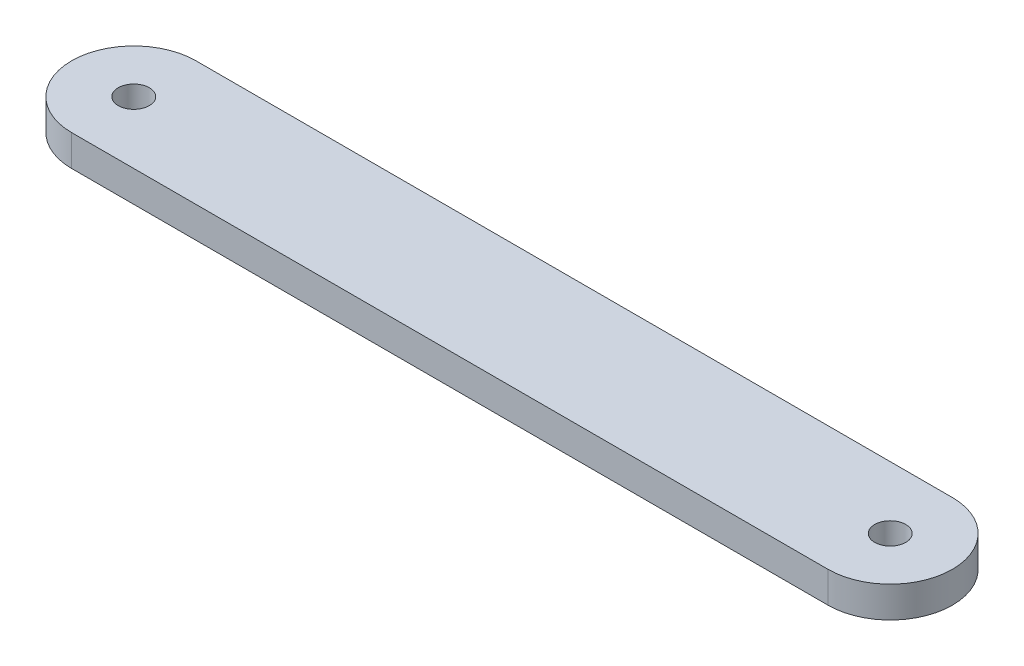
ISO-10303-21;
HEADER;
FILE_DESCRIPTION(('STEP AP214'),'2;1');
FILE_NAME('part.step','',(''),(''),'','','');
FILE_SCHEMA(('AUTOMOTIVE_DESIGN { 1 0 10303 214 1 1 1 1 }'));
ENDSEC;
DATA;
#1=APPLICATION_CONTEXT('core data for automotive mechanical design processes');
#2=APPLICATION_PROTOCOL_DEFINITION('international standard','automotive_design',2000,#1);
#3=PRODUCT_CONTEXT('',#1,'mechanical');
#4=PRODUCT('Part','Part','',(#3));
#5=PRODUCT_RELATED_PRODUCT_CATEGORY('part','',(#4));
#6=PRODUCT_DEFINITION_FORMATION('','',#4);
#7=PRODUCT_DEFINITION_CONTEXT('part definition',#1,'design');
#8=PRODUCT_DEFINITION('design','',#6,#7);
#9=PRODUCT_DEFINITION_SHAPE('','',#8);
#10=(LENGTH_UNIT() NAMED_UNIT(*) SI_UNIT(.MILLI.,.METRE.));
#11=(NAMED_UNIT(*) PLANE_ANGLE_UNIT() SI_UNIT($,.RADIAN.));
#12=(NAMED_UNIT(*) SI_UNIT($,.STERADIAN.) SOLID_ANGLE_UNIT());
#13=UNCERTAINTY_MEASURE_WITH_UNIT(LENGTH_MEASURE(1.E-05),#10,'distance_accuracy_value','');
#14=(GEOMETRIC_REPRESENTATION_CONTEXT(3) GLOBAL_UNCERTAINTY_ASSIGNED_CONTEXT((#13)) GLOBAL_UNIT_ASSIGNED_CONTEXT((#10,
#11,#12)) REPRESENTATION_CONTEXT('',''));
#15=CARTESIAN_POINT('',(0.,0.,0.));
#16=DIRECTION('',(0.,0.,1.));
#17=DIRECTION('',(1.,0.,0.));
#18=AXIS2_PLACEMENT_3D('',#15,#16,#17);
#19=CARTESIAN_POINT('',(0.,6.35,0.));
#20=DIRECTION('',(0.,-1.,0.));
#21=DIRECTION('',(0.,0.,-1.));
#22=AXIS2_PLACEMENT_3D('',#19,#20,#21);
#23=CYLINDRICAL_SURFACE('',#22,12.7);
#24=CARTESIAN_POINT('',(0.,0.,0.));
#25=DIRECTION('',(0.,1.,0.));
#26=DIRECTION('',(0.,0.,1.));
#27=AXIS2_PLACEMENT_3D('',#24,#25,#26);
#28=CIRCLE('',#27,12.7);
#29=CARTESIAN_POINT('',(0.,0.,-12.7));
#30=VERTEX_POINT('',#29);
#31=CARTESIAN_POINT('',(0.,0.,12.7));
#32=VERTEX_POINT('',#31);
#33=EDGE_CURVE('E106',#30,#32,#28,.T.);
#34=ORIENTED_EDGE('',*,*,#33,.T.);
#35=DIRECTION('',(0.,-1.,0.));
#36=VECTOR('',#35,1.);
#37=CARTESIAN_POINT('',(0.,6.35,12.7));
#38=LINE('',#37,#36);
#39=CARTESIAN_POINT('',(0.,6.35,12.7));
#40=VERTEX_POINT('',#39);
#41=EDGE_CURVE('E11',#40,#32,#38,.T.);
#42=ORIENTED_EDGE('',*,*,#41,.F.);
#43=CARTESIAN_POINT('',(0.,6.35,0.));
#44=DIRECTION('',(0.,1.,0.));
#45=DIRECTION('',(0.,0.,1.));
#46=AXIS2_PLACEMENT_3D('',#43,#44,#45);
#47=CIRCLE('',#46,12.7);
#48=CARTESIAN_POINT('',(0.,6.35,-12.7));
#49=VERTEX_POINT('',#48);
#50=EDGE_CURVE('E86',#49,#40,#47,.T.);
#51=ORIENTED_EDGE('',*,*,#50,.F.);
#52=DIRECTION('',(0.,-1.,0.));
#53=VECTOR('',#52,1.);
#54=CARTESIAN_POINT('',(0.,6.35,-12.7));
#55=LINE('',#54,#53);
#56=EDGE_CURVE('E52',#49,#30,#55,.T.);
#57=ORIENTED_EDGE('',*,*,#56,.T.);
#58=EDGE_LOOP('',(#34,#42,#51,#57));
#59=FACE_BOUND('',#58,.T.);
#60=ADVANCED_FACE('F35',(#59),#23,.T.);
#61=CARTESIAN_POINT('',(0.,6.35,12.7));
#62=DIRECTION('',(0.,0.,-1.));
#63=DIRECTION('',(-1.,0.,0.));
#64=AXIS2_PLACEMENT_3D('',#61,#62,#63);
#65=PLANE('',#64);
#66=DIRECTION('',(1.,0.,0.));
#67=VECTOR('',#66,1.);
#68=CARTESIAN_POINT('',(0.,0.,12.7));
#69=LINE('',#68,#67);
#70=CARTESIAN_POINT('',(154.5082,0.,12.7));
#71=VERTEX_POINT('',#70);
#72=EDGE_CURVE('E91',#32,#71,#69,.T.);
#73=ORIENTED_EDGE('',*,*,#72,.T.);
#74=DIRECTION('',(0.,-1.,0.));
#75=VECTOR('',#74,1.);
#76=CARTESIAN_POINT('',(154.5082,6.35,12.7));
#77=LINE('',#76,#75);
#78=CARTESIAN_POINT('',(154.5082,6.35,12.7));
#79=VERTEX_POINT('',#78);
#80=EDGE_CURVE('E44',#79,#71,#77,.T.);
#81=ORIENTED_EDGE('',*,*,#80,.F.);
#82=DIRECTION('',(1.,0.,0.));
#83=VECTOR('',#82,1.);
#84=CARTESIAN_POINT('',(0.,6.35,12.7));
#85=LINE('',#84,#83);
#86=EDGE_CURVE('E78',#40,#79,#85,.T.);
#87=ORIENTED_EDGE('',*,*,#86,.F.);
#88=ORIENTED_EDGE('',*,*,#41,.T.);
#89=EDGE_LOOP('',(#73,#81,#87,#88));
#90=FACE_BOUND('',#89,.T.);
#91=ADVANCED_FACE('F90',(#90),#65,.F.);
#92=CARTESIAN_POINT('',(154.5082,6.35,0.));
#93=DIRECTION('',(0.,-1.,0.));
#94=DIRECTION('',(0.,0.,-1.));
#95=AXIS2_PLACEMENT_3D('',#92,#93,#94);
#96=CYLINDRICAL_SURFACE('',#95,12.7);
#97=CARTESIAN_POINT('',(154.5082,0.,0.));
#98=DIRECTION('',(0.,1.,0.));
#99=DIRECTION('',(0.,0.,1.));
#100=AXIS2_PLACEMENT_3D('',#97,#98,#99);
#101=CIRCLE('',#100,12.7);
#102=CARTESIAN_POINT('',(154.5082,0.,-12.7));
#103=VERTEX_POINT('',#102);
#104=EDGE_CURVE('E109',#71,#103,#101,.T.);
#105=ORIENTED_EDGE('',*,*,#104,.T.);
#106=DIRECTION('',(0.,-1.,0.));
#107=VECTOR('',#106,1.);
#108=CARTESIAN_POINT('',(154.5082,6.35,-12.7));
#109=LINE('',#108,#107);
#110=CARTESIAN_POINT('',(154.5082,6.35,-12.7));
#111=VERTEX_POINT('',#110);
#112=EDGE_CURVE('E67',#111,#103,#109,.T.);
#113=ORIENTED_EDGE('',*,*,#112,.F.);
#114=CARTESIAN_POINT('',(154.5082,6.35,0.));
#115=DIRECTION('',(0.,1.,0.));
#116=DIRECTION('',(0.,0.,1.));
#117=AXIS2_PLACEMENT_3D('',#114,#115,#116);
#118=CIRCLE('',#117,12.7);
#119=EDGE_CURVE('E85',#79,#111,#118,.T.);
#120=ORIENTED_EDGE('',*,*,#119,.F.);
#121=ORIENTED_EDGE('',*,*,#80,.T.);
#122=EDGE_LOOP('',(#105,#113,#120,#121));
#123=FACE_BOUND('',#122,.T.);
#124=ADVANCED_FACE('F94',(#123),#96,.T.);
#125=CARTESIAN_POINT('',(0.,6.35,-12.7));
#126=DIRECTION('',(0.,0.,-1.));
#127=DIRECTION('',(-1.,0.,0.));
#128=AXIS2_PLACEMENT_3D('',#125,#126,#127);
#129=PLANE('',#128);
#130=DIRECTION('',(1.,0.,0.));
#131=VECTOR('',#130,1.);
#132=CARTESIAN_POINT('',(0.,0.,-12.7));
#133=LINE('',#132,#131);
#134=EDGE_CURVE('E111',#30,#103,#133,.T.);
#135=ORIENTED_EDGE('',*,*,#134,.F.);
#136=ORIENTED_EDGE('',*,*,#56,.F.);
#137=DIRECTION('',(1.,0.,0.));
#138=VECTOR('',#137,1.);
#139=CARTESIAN_POINT('',(0.,6.35,-12.7));
#140=LINE('',#139,#138);
#141=EDGE_CURVE('E95',#49,#111,#140,.T.);
#142=ORIENTED_EDGE('',*,*,#141,.T.);
#143=ORIENTED_EDGE('',*,*,#112,.T.);
#144=EDGE_LOOP('',(#135,#136,#142,#143));
#145=FACE_BOUND('',#144,.T.);
#146=ADVANCED_FACE('F147',(#145),#129,.T.);
#147=CARTESIAN_POINT('',(0.,6.35,0.));
#148=DIRECTION('',(0.,-1.,0.));
#149=DIRECTION('',(0.,0.,-1.));
#150=AXIS2_PLACEMENT_3D('',#147,#148,#149);
#151=CYLINDRICAL_SURFACE('',#150,3.175);
#152=CARTESIAN_POINT('',(0.,6.35,0.));
#153=DIRECTION('',(0.,1.,0.));
#154=DIRECTION('',(0.,0.,1.));
#155=AXIS2_PLACEMENT_3D('',#152,#153,#154);
#156=CIRCLE('',#155,3.175);
#157=CARTESIAN_POINT('',(0.,6.35,3.175));
#158=VERTEX_POINT('',#157);
#159=EDGE_CURVE('E117',#158,#158,#156,.T.);
#160=ORIENTED_EDGE('',*,*,#159,.T.);
#161=EDGE_LOOP('',(#160));
#162=FACE_BOUND('',#161,.T.);
#163=CARTESIAN_POINT('',(0.,0.,0.));
#164=DIRECTION('',(0.,1.,0.));
#165=DIRECTION('',(0.,0.,1.));
#166=AXIS2_PLACEMENT_3D('',#163,#164,#165);
#167=CIRCLE('',#166,3.175);
#168=CARTESIAN_POINT('',(0.,0.,3.175));
#169=VERTEX_POINT('',#168);
#170=EDGE_CURVE('E103',#169,#169,#167,.T.);
#171=ORIENTED_EDGE('',*,*,#170,.F.);
#172=EDGE_LOOP('',(#171));
#173=FACE_BOUND('',#172,.T.);
#174=ADVANCED_FACE('F37',(#162,#173),#151,.F.);
#175=CARTESIAN_POINT('',(154.5082,6.35,0.));
#176=DIRECTION('',(0.,-1.,0.));
#177=DIRECTION('',(0.,0.,-1.));
#178=AXIS2_PLACEMENT_3D('',#175,#176,#177);
#179=CYLINDRICAL_SURFACE('',#178,3.175);
#180=CARTESIAN_POINT('',(154.5082,6.35,0.));
#181=DIRECTION('',(0.,1.,0.));
#182=DIRECTION('',(0.,0.,1.));
#183=AXIS2_PLACEMENT_3D('',#180,#181,#182);
#184=CIRCLE('',#183,3.175);
#185=CARTESIAN_POINT('',(154.5082,6.35,3.17499999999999));
#186=VERTEX_POINT('',#185);
#187=EDGE_CURVE('E97',#186,#186,#184,.T.);
#188=ORIENTED_EDGE('',*,*,#187,.T.);
#189=EDGE_LOOP('',(#188));
#190=FACE_BOUND('',#189,.T.);
#191=CARTESIAN_POINT('',(154.5082,0.,0.));
#192=DIRECTION('',(0.,1.,0.));
#193=DIRECTION('',(0.,0.,1.));
#194=AXIS2_PLACEMENT_3D('',#191,#192,#193);
#195=CIRCLE('',#194,3.175);
#196=CARTESIAN_POINT('',(154.5082,0.,3.17499999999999));
#197=VERTEX_POINT('',#196);
#198=EDGE_CURVE('E114',#197,#197,#195,.T.);
#199=ORIENTED_EDGE('',*,*,#198,.F.);
#200=EDGE_LOOP('',(#199));
#201=FACE_BOUND('',#200,.T.);
#202=ADVANCED_FACE('F129',(#190,#201),#179,.F.);
#203=CARTESIAN_POINT('',(0.,6.35,0.));
#204=DIRECTION('',(0.,1.,0.));
#205=DIRECTION('',(0.,0.,1.));
#206=AXIS2_PLACEMENT_3D('',#203,#204,#205);
#207=PLANE('',#206);
#208=ORIENTED_EDGE('',*,*,#159,.F.);
#209=EDGE_LOOP('',(#208));
#210=FACE_BOUND('',#209,.T.);
#211=ORIENTED_EDGE('',*,*,#50,.T.);
#212=ORIENTED_EDGE('',*,*,#86,.T.);
#213=ORIENTED_EDGE('',*,*,#119,.T.);
#214=ORIENTED_EDGE('',*,*,#141,.F.);
#215=EDGE_LOOP('',(#211,#212,#213,#214));
#216=FACE_BOUND('',#215,.T.);
#217=ORIENTED_EDGE('',*,*,#187,.F.);
#218=EDGE_LOOP('',(#217));
#219=FACE_BOUND('',#218,.T.);
#220=ADVANCED_FACE('F81',(#210,#216,#219),#207,.T.);
#221=CARTESIAN_POINT('',(0.,0.,0.));
#222=DIRECTION('',(0.,1.,0.));
#223=DIRECTION('',(0.,0.,1.));
#224=AXIS2_PLACEMENT_3D('',#221,#222,#223);
#225=PLANE('',#224);
#226=ORIENTED_EDGE('',*,*,#170,.T.);
#227=EDGE_LOOP('',(#226));
#228=FACE_BOUND('',#227,.T.);
#229=ORIENTED_EDGE('',*,*,#33,.F.);
#230=ORIENTED_EDGE('',*,*,#134,.T.);
#231=ORIENTED_EDGE('',*,*,#104,.F.);
#232=ORIENTED_EDGE('',*,*,#72,.F.);
#233=EDGE_LOOP('',(#229,#230,#231,#232));
#234=FACE_BOUND('',#233,.T.);
#235=ORIENTED_EDGE('',*,*,#198,.T.);
#236=EDGE_LOOP('',(#235));
#237=FACE_BOUND('',#236,.T.);
#238=ADVANCED_FACE('F128',(#228,#234,#237),#225,.F.);
#239=CLOSED_SHELL('',(#60,#91,#124,#146,#174,#202,#220,#238));
#240=MANIFOLD_SOLID_BREP('B2',#239);
#241=ADVANCED_BREP_SHAPE_REPRESENTATION('',(#18,#240),#14);
#242=SHAPE_DEFINITION_REPRESENTATION(#9,#241);
ENDSEC;
END-ISO-10303-21;
